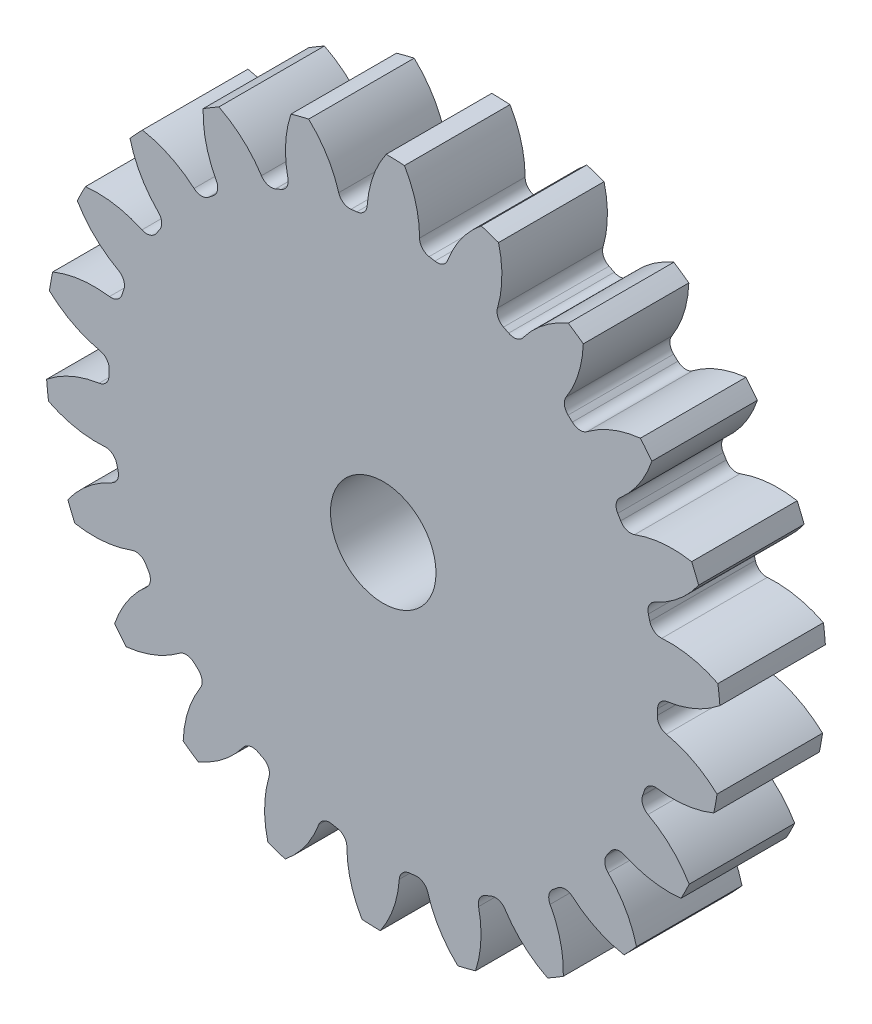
from build123d import *

# Parameters (mm, degrees)
SKETCH3_R         = 406.4
GEARBODY_DEPTH    = 127
TOOTHCUT_DEPTH    = 589.600815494
CIRPATTERN1_COUNT = 22
BOREDIA_R         = 63.5
BORE_DEPTH        = 12700


with BuildPart() as part:
    # Sketch3 → gearBody (new body)
    with BuildSketch(Plane.XY):
        Circle(SKETCH3_R)
    extrude(amount=GEARBODY_DEPTH)

    # Sketch2 → toothCut (cut, through all)
    with BuildSketch(Plane.XY):
        with BuildLine():
            ThreePointArc((329.843062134, -15.349083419), (329.98776982, -11.83688173), (330.095080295, -8.323338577))
            ThreePointArc((330.095080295, -8.323338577), (333.573652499, 0.488102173), (341.917774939, 4.973363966))
            ThreePointArc((341.917774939, 4.973363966), (376.124175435, 14.787627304), (406.4, 33.489820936))
            ThreePointArc((406.4, 33.489820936), (407.515455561, -14.617851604), (402.955993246, -62.52196105))
            ThreePointArc((402.955993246, -62.52196105), (374.097976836, -41.698597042), (340.682673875, -29.458698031))
            ThreePointArc((340.682673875, -29.458698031), (332.681361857, -24.387114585), (329.843062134, -15.349083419))
        make_face()
    toothcut = extrude(amount=TOOTHCUT_DEPTH, mode=Mode.SUBTRACT)

    # CirPattern1: toothCut ×22 about axis
    cirpattern1_axis = Axis((0, 0, 0), (0, 0, 1))
    for i in range(1, CIRPATTERN1_COUNT):
        add(toothcut.rotate(cirpattern1_axis, i * 360 / CIRPATTERN1_COUNT), mode=Mode.SUBTRACT)

    # boreDia → bore (cut, symmetric)
    with BuildSketch(Plane.XY):
        Circle(BOREDIA_R)
    extrude(amount=BORE_DEPTH, both=True, mode=Mode.SUBTRACT)


solid = part.part
